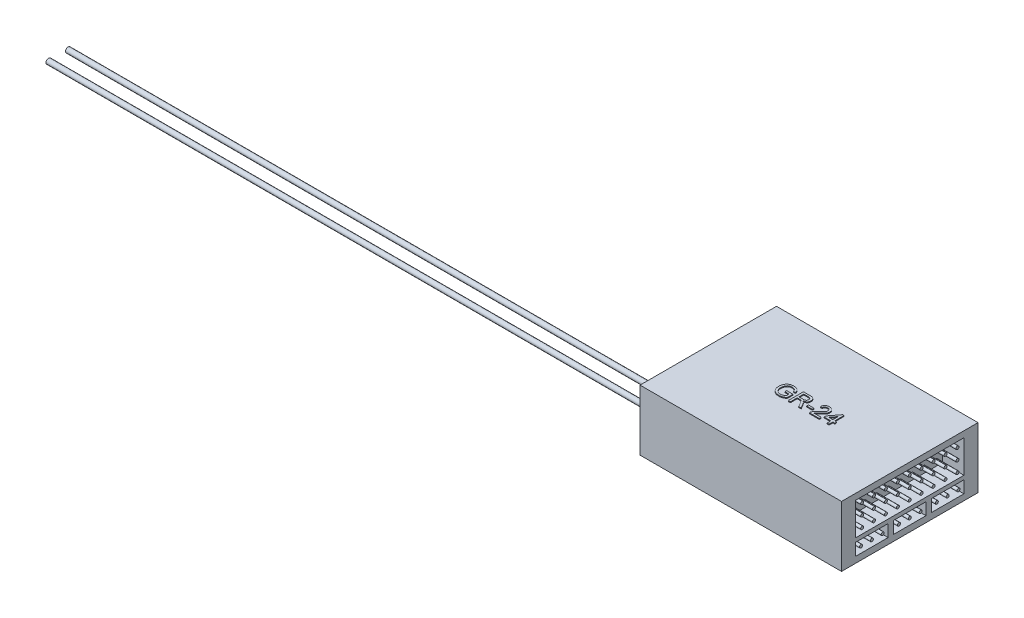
from build123d import *

# Parameters (mm, degrees)
ESQUISSE1_W                     = 46.5
ESQUISSE1_H                     = 31.5
BOSS_EXTRU_1_DEPTH              = 14
ESQUISSE2_W                     = 25
ESQUISSE2_H                     = 7.5
ESQUISSE2_W_2                   = 7.5
ESQUISSE2_H_2                   = 2.8
ENL_V_MAT_EXTRU_1_DEPTH         = 5
ESQUISSE3_R                     = 0.35
BOSS_EXTRU_2_DEPTH              = 5
BOSS_EXTRU_2_2_DEPTH            = 5
BOSS_EXTRU_2_3_DEPTH            = 5
R_P_TITION_LIN_AIRE1_COUNT      = 5
R_P_TITION_LIN_AIRE1_PITCH      = 2.75
R_P_TITION_LIN_AIRE1_COUNT_DIR2 = 5
R_P_TITION_LIN_AIRE1_PITCH_DIR2 = 2.75
ESQUISSE4_R                     = 0.35
BOSS_EXTRU_3_DEPTH              = 5
BOSS_EXTRU_3_2_DEPTH            = 5
BOSS_EXTRU_3_3_DEPTH            = 5
BOSS_EXTRU_3_4_DEPTH            = 5
BOSS_EXTRU_3_5_DEPTH            = 5
BOSS_EXTRU_3_6_DEPTH            = 5
BOSS_EXTRU_3_7_DEPTH            = 5
BOSS_EXTRU_3_8_DEPTH            = 5
BOSS_EXTRU_3_9_DEPTH            = 5
ESQUISSE5_R                     = 0.6
BOSS_EXTRU_4_DEPTH              = 143
ESQUISSE6_W                     = 7.5
ESQUISSE6_H                     = 2.8
ENL_V_MAT_EXTRU_2_DEPTH         = 5
ESQUISSE7_R                     = 0.35
BOSS_EXTRU_5_DEPTH              = 5
BOSS_EXTRU_5_2_DEPTH            = 5
BOSS_EXTRU_5_3_DEPTH            = 5
ESQUISSE8_W                     = 1.301282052
ESQUISSE8_H                     = 0.403846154
BOSS_EXTRU_6_DEPTH              = 0.2


with BuildPart() as part:
    # Esquisse1 → Boss.-Extru.1 (new body)
    with BuildSketch(Plane(origin=(0, 0, 0), x_dir=(1, 0, 0), z_dir=(0, 1, 0))):
        with Locations((23.25, 0)):
            Rectangle(ESQUISSE1_W, ESQUISSE1_H)
    extrude(amount=BOSS_EXTRU_1_DEPTH)

    # Esquisse2 → Enl_v. mat.-Extru.1 (cut)
    with BuildSketch(Plane(origin=(46.5, 0, 0), x_dir=(0, 0, -1), z_dir=(1, 0, 0))):
        with Locations((0, 8.85)):
            Rectangle(ESQUISSE2_W, ESQUISSE2_H)
        with Locations((-8.75, 2.8)):
            Rectangle(ESQUISSE2_W_2, ESQUISSE2_H_2)
        with Locations((0, 2.8)):
            Rectangle(ESQUISSE2_W_2, ESQUISSE2_H_2)
        with Locations((8.75, 2.8)):
            Rectangle(ESQUISSE2_W_2, ESQUISSE2_H_2)
    extrude(amount=-ENL_V_MAT_EXTRU_1_DEPTH, mode=Mode.SUBTRACT)


with BuildPart() as body_2:
    # Esquisse3 → Boss.-Extru.2 (new body)
    with BuildSketch(Plane(origin=(41.5, 0, 0), x_dir=(0, 0, -1), z_dir=(1, 0, 0))):
        with Locations((0, 11.35)):
            Circle(ESQUISSE3_R)
    boss_extru_2 = extrude(amount=BOSS_EXTRU_2_DEPTH)


with BuildPart() as body_3:
    # Esquisse3 → Boss.-Extru.2 2 (new body)
    with BuildSketch(Plane(origin=(41.5, 0, 0), x_dir=(0, 0, -1), z_dir=(1, 0, 0))):
        with Locations((0, 8.85)):
            Circle(ESQUISSE3_R)
    boss_extru_2_2 = extrude(amount=BOSS_EXTRU_2_2_DEPTH)


with BuildPart() as body_4:
    # Esquisse3 → Boss.-Extru.2 3 (new body)
    with BuildSketch(Plane(origin=(41.5, 0, 0), x_dir=(0, 0, -1), z_dir=(1, 0, 0))):
        with Locations((0, 6.35)):
            Circle(ESQUISSE3_R)
    boss_extru_2_3 = extrude(amount=BOSS_EXTRU_2_3_DEPTH)


with BuildPart() as part_1:
    add(part.part)

    # R_p_tition lin_aire1: Boss.-Extru.2, Boss.-Extru.2 2, Boss.-Extru.2 3 5 × 5
    with Locations(*[Vector(0, 0, -1) * (i * R_P_TITION_LIN_AIRE1_PITCH) + Vector(0, 0, 1) * (j * R_P_TITION_LIN_AIRE1_PITCH_DIR2) for i in range(R_P_TITION_LIN_AIRE1_COUNT) for j in range(R_P_TITION_LIN_AIRE1_COUNT_DIR2) if (i, j) != (0, 0)]):
        add(boss_extru_2)
        add(boss_extru_2_2)
        add(boss_extru_2_3)

    # Esquisse5 → Boss.-Extru.4 (add)
    with BuildSketch(Plane.ZY):
        with Locations(Location((4.75, 4, 0), (0, 0, 180))):
            Circle(ESQUISSE5_R)
        with Locations(Location((9.25, 4, 0), (0, 0, 180))):
            Circle(ESQUISSE5_R)
    extrude(amount=BOSS_EXTRU_4_DEPTH)

    # Esquisse6 → Enl_v. mat.-Extru.2 (cut)
    with BuildSketch(Plane.ZY):
        with Locations((3.5, 11.3)):
            Rectangle(ESQUISSE6_W, ESQUISSE6_H)
    extrude(amount=-ENL_V_MAT_EXTRU_2_DEPTH, mode=Mode.SUBTRACT)

    # Esquisse8 → Boss.-Extru.6 (add)
    # profile 1 of 5: a face of its own
    with BuildSketch(Plane(origin=(0, 14, 0), x_dir=(1, 0, 0), z_dir=(0, 1, 0))):
        with BuildLine():
            Line((18.233725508, -0.535342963), (18.233725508, -0.131496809))
            Line((18.233725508, -0.131496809), (19.669622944, -0.131496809))
            Line((19.669622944, -0.131496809), (19.669622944, -1.426468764))
            add(Edge.make_bspline(
                [(19.669622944, -1.426468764), (19.612969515, -1.469617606), (19.501468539, -1.554539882), (19.326601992, -1.665290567), (19.148867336, -1.759220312), (18.968755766, -1.836765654), (18.785648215, -1.89661519), (18.600335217, -1.939454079), (18.412614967, -1.966587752), (18.286399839, -1.969688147), (18.223208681, -1.971240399)],
                knots=[0, 0, 0, 0, 1.08433114, 2.134098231, 3.14842993, 4.143565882, 5.117308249, 6.078377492, 7.037916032, 8, 8, 8, 8], degree=3))
            add(Edge.make_bspline(
                [(18.223208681, -1.971240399), (18.180883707, -1.970590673), (18.096803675, -1.969299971), (17.972318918, -1.958257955), (17.850740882, -1.941851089), (17.732300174, -1.917725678), (17.616578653, -1.887011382), (17.503799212, -1.849054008), (17.393914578, -1.804760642), (17.287537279, -1.753980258), (17.18626623, -1.695798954), (17.090380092, -1.632007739), (17.001088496, -1.561645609), (16.918254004, -1.485288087), (16.842176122, -1.402480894), (16.771727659, -1.314324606), (16.708798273, -1.219203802), (16.651998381, -1.118868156), (16.601843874, -1.014076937), (16.558052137, -0.905724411), (16.521854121, -0.794070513), (16.491664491, -0.679609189), (16.467656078, -0.562383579), (16.450886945, -0.442026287), (16.44101582, -0.318629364), (16.439579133, -0.235280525), (16.438853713, -0.193195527)],
                knots=[0, 0, 0, 0, 1.072770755, 2.131096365, 3.165876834, 4.181397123, 5.193125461, 6.199217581, 7.195986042, 8.195005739, 9.184865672, 10.154356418, 11.112044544, 12.063776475, 13.007136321, 13.960176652, 14.921449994, 15.895149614, 16.88092309, 17.86448639, 18.855604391, 19.854360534, 20.864074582, 21.88711945, 22.933151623, 24, 24, 24, 24], degree=3))
            add(Edge.make_bspline(
                [(16.438853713, -0.193195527), (16.439581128, -0.151344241), (16.441025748, -0.068229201), (16.450981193, 0.055624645), (16.467811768, 0.177309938), (16.491047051, 0.296896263), (16.520369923, 0.414279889), (16.556899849, 0.529483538), (16.600604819, 0.642401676), (16.650103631, 0.752795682), (16.705233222, 0.859086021), (16.768544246, 0.957875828), (16.835107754, 1.051473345), (16.910415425, 1.135809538), (16.989225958, 1.215238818), (17.075395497, 1.285932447), (17.16675209, 1.350018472), (17.263690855, 1.406808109), (17.365641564, 1.456368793), (17.471387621, 1.500017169), (17.581169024, 1.536237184), (17.694356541, 1.566795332), (17.811577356, 1.589500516), (17.932529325, 1.606580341), (18.057349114, 1.616335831), (18.141862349, 1.617774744), (18.184646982, 1.618503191)],
                knots=[0, 0, 0, 0, 1.059979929, 2.105079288, 3.144800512, 4.169876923, 5.189194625, 6.207600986, 7.228841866, 8.254191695, 9.270945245, 10.257936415, 11.22408152, 12.176290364, 13.118065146, 14.055588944, 14.994904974, 15.942096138, 16.897776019, 17.864011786, 18.837383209, 19.823806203, 20.831455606, 21.859450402, 22.916351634, 24, 24, 24, 24], degree=3))
            add(Edge.make_bspline(
                [(18.184646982, 1.618503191), (18.246410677, 1.617017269), (18.36708879, 1.614113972), (18.543769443, 1.591533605), (18.710867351, 1.55289545), (18.843291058, 1.508504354), (18.942751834, 1.465244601), (19.013056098, 1.430282), (19.079140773, 1.392103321), (19.141766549, 1.351949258), (19.199535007, 1.307184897), (19.253205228, 1.259915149), (19.302918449, 1.209573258), (19.364122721, 1.137725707), (19.434137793, 1.037922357), (19.504388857, 0.902395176), (19.565920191, 0.751319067), (19.596374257, 0.643129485), (19.612130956, 0.587153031)],
                knots=[0, 0, 0, 0, 1.539867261, 3.008697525, 4.432261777, 5.810773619, 6.484177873, 7.135742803, 7.767512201, 8.386601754, 8.989234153, 9.587908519, 10.168964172, 10.7517707, 11.940093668, 13.199243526, 14.550910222, 16, 16, 16, 16], degree=3))
            Line((19.612130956, 0.587153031), (19.16060852, 0.4735713))
            add(Edge.make_bspline(
                [(19.16060852, 0.4735713), (19.147576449, 0.515107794), (19.122617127, 0.594659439), (19.07865403, 0.70584478), (19.027440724, 0.801852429), (18.972681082, 0.886360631), (18.907443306, 0.959057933), (18.831699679, 1.023472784), (18.74318225, 1.079414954), (18.64384022, 1.12731246), (18.535837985, 1.166424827), (18.420887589, 1.194297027), (18.300159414, 1.211631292), (18.217659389, 1.213634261), (18.175532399, 1.214657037)],
                knots=[0, 0, 0, 0, 1.164883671, 2.23101188, 3.193404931, 4.072828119, 4.918883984, 5.797350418, 6.725503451, 7.712871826, 8.743577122, 9.793233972, 10.87315899, 12, 12, 12, 12], degree=3))
            add(Edge.make_bspline(
                [(18.175532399, 1.214657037), (18.125701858, 1.213400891), (18.02922382, 1.210968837), (17.889413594, 1.193534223), (17.760033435, 1.163792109), (17.641516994, 1.121412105), (17.534362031, 1.06931814), (17.437035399, 1.01041139), (17.351187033, 0.942973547), (17.276490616, 0.867864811), (17.211529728, 0.787516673), (17.153602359, 0.703765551), (17.103226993, 0.615935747), (17.076320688, 0.554236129), (17.06285211, 0.523350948)],
                knots=[0, 0, 0, 0, 1.282088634, 2.482280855, 3.618640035, 4.691464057, 5.71354971, 6.679981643, 7.61357903, 8.515091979, 9.399860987, 10.268958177, 11.133486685, 12, 12, 12, 12], degree=3))
            add(Edge.make_bspline(
                [(17.06285211, 0.523350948), (17.042739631, 0.46902939), (17.002256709, 0.359689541), (16.962708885, 0.187366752), (16.937180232, 0.008562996), (16.934038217, -0.113176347), (16.932443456, -0.17496636)],
                knots=[0, 0, 0, 0, 0.971932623, 1.956331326, 2.96271565, 4, 4, 4, 4], degree=3))
            add(Edge.make_bspline(
                [(16.932443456, -0.17496636), (16.932685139, -0.212845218), (16.933158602, -0.287051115), (16.941644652, -0.396006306), (16.952740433, -0.500525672), (16.970748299, -0.60009665), (16.992158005, -0.695016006), (17.01871357, -0.785335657), (17.051173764, -0.870604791), (17.087429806, -0.951658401), (17.128912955, -1.027620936), (17.175108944, -1.098411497), (17.225846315, -1.163992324), (17.280952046, -1.224435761), (17.3396087, -1.280955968), (17.403653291, -1.33139608), (17.472365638, -1.376488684), (17.568766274, -1.430188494), (17.695873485, -1.484399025), (17.853431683, -1.532765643), (18.016270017, -1.561491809), (18.126343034, -1.565415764), (18.181842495, -1.567394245)],
                knots=[0, 0, 0, 0, 1.070760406, 2.097653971, 3.088708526, 4.041547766, 4.95691435, 5.839291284, 6.700934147, 7.534993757, 8.348268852, 9.145600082, 9.922850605, 10.690119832, 11.456705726, 12.223547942, 12.991528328, 13.778467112, 15.341275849, 16.888285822, 18.431055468, 20, 20, 20, 20], degree=3))
            add(Edge.make_bspline(
                [(18.181842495, -1.567394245), (18.230527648, -1.565791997), (18.327673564, -1.562594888), (18.472303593, -1.54040942), (18.614659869, -1.502737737), (18.752295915, -1.451876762), (18.881045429, -1.393619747), (18.995010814, -1.331197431), (19.093974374, -1.268910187), (19.14964125, -1.221216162), (19.1760332, -1.198604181)],
                knots=[0, 0, 0, 0, 1.08078364, 2.156585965, 3.240205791, 4.344938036, 5.41078367, 6.374425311, 7.229306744, 8, 8, 8, 8], degree=3))
            Line((19.1760332, -1.198604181), (19.1760332, -0.535342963))
            Line((19.1760332, -0.535342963), (18.233725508, -0.535342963))
        make_face()
    # profile 2 of 5: a face of its own
    with BuildSketch(Plane(origin=(0, 14, 0), x_dir=(1, 0, 0), z_dir=(0, 1, 0))):
        with BuildLine():
            Line((20.387571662, -1.926368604), (20.387571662, 1.573631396))
            Line((20.387571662, 1.573631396), (21.906201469, 1.573631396))
            add(Edge.make_bspline(
                [(21.906201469, 1.573631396), (21.941960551, 1.573351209), (22.011168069, 1.57280894), (22.111533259, 1.568970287), (22.205214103, 1.560695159), (22.292382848, 1.551746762), (22.373024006, 1.538012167), (22.447054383, 1.522258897), (22.514588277, 1.503512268), (22.575927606, 1.481371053), (22.632837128, 1.456321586), (22.685587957, 1.425414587), (22.736372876, 1.391547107), (22.783307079, 1.351757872), (22.827628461, 1.308192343), (22.869295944, 1.260258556), (22.907692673, 1.207540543), (22.95505044, 1.132090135), (23.005855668, 1.03160608), (23.048184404, 0.903008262), (23.075477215, 0.76849025), (23.078397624, 0.676562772), (23.079879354, 0.62992146)],
                knots=[0, 0, 0, 0, 1.242255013, 2.404239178, 3.487702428, 4.508875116, 5.447164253, 6.327763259, 7.137389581, 7.87956647, 8.591787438, 9.293660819, 10.000726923, 10.709654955, 11.427269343, 12.158170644, 12.913245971, 13.690346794, 15.251572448, 16.809945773, 18.381459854, 20, 20, 20, 20], degree=3))
            add(Edge.make_bspline(
                [(23.079879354, 0.62992146), (23.079194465, 0.599981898), (23.077841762, 0.540849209), (23.06747992, 0.453908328), (23.048731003, 0.370839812), (23.024689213, 0.290916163), (22.991783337, 0.21526977), (22.953663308, 0.142355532), (22.906438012, 0.0741766), (22.853564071, 0.008917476), (22.792931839, -0.052024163), (22.724007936, -0.106449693), (22.647475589, -0.155405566), (22.562974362, -0.19754107), (22.471476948, -0.236054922), (22.371835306, -0.26706813), (22.264451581, -0.292392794), (22.190008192, -0.304655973), (22.151594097, -0.310983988)],
                knots=[0, 0, 0, 0, 0.982609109, 1.940720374, 2.867584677, 3.775009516, 4.675469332, 5.571146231, 6.471115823, 7.392408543, 8.32534739, 9.286126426, 10.269214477, 11.301811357, 12.381622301, 13.524260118, 14.722474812, 16, 16, 16, 16], degree=3))
            add(Edge.make_bspline(
                [(22.151594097, -0.310983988), (22.179772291, -0.32521899), (22.233283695, -0.352251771), (22.307370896, -0.394638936), (22.370172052, -0.437948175), (22.406555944, -0.468924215), (22.423629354, -0.48345995)],
                knots=[0, 0, 0, 0, 1.172304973, 2.226249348, 3.167654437, 4, 4, 4, 4], degree=3))
            add(Edge.make_bspline(
                [(22.423629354, -0.48345995), (22.456692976, -0.515871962), (22.524608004, -0.582448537), (22.618197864, -0.695847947), (22.708936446, -0.822078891), (22.764066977, -0.913306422), (22.792419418, -0.96022277)],
                knots=[0, 0, 0, 0, 0.918110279, 1.885863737, 2.912745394, 4, 4, 4, 4], degree=3))
            Line((22.792419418, -0.96022277), (23.366638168, -1.926368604))
            Line((23.366638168, -1.926368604), (22.800832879, -1.926368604))
            Line((22.800832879, -1.926368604), (22.364735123, -1.187386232))
            add(Edge.make_bspline(
                [(22.364735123, -1.187386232), (22.349055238, -1.161458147), (22.318670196, -1.111213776), (22.274780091, -1.037834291), (22.231747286, -0.970276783), (22.191835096, -0.906610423), (22.153423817, -0.84799104), (22.116884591, -0.794215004), (22.083222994, -0.744576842), (22.041528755, -0.686785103), (21.993003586, -0.622838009), (21.936378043, -0.556984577), (21.882453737, -0.504480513), (21.816044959, -0.452994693), (21.733787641, -0.404838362), (21.663867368, -0.382711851), (21.629959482, -0.371981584)],
                knots=[0, 0, 0, 0, 1.130940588, 2.191577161, 3.191089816, 4.120344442, 4.99615009, 5.80661983, 6.546979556, 7.234477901, 8.466216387, 9.541989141, 10.473533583, 11.269175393, 12.675684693, 14, 14, 14, 14], degree=3))
            add(Edge.make_bspline(
                [(21.629959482, -0.371981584), (21.61573299, -0.369416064), (21.583253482, -0.363558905), (21.528103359, -0.359733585), (21.461282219, -0.35567352), (21.4128558, -0.355791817), (21.386670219, -0.355855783)],
                knots=[0, 0, 0, 0, 0.709978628, 1.620902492, 2.713552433, 4, 4, 4, 4], degree=3))
            Line((21.386670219, -0.355855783), (20.881161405, -0.355855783))
            Line((20.881161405, -0.355855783), (20.881161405, -1.926368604))
            Line((20.881161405, -1.926368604), (20.387571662, -1.926368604))
        make_face()
        with BuildLine():
            Line((20.881161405, 0.047990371), (21.818561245, 0.047990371))
            add(Edge.make_bspline(
                [(21.818561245, 0.047990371), (21.865566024, 0.048725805), (21.953437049, 0.050100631), (22.076310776, 0.061840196), (22.181026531, 0.080494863), (22.269654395, 0.10770488), (22.34411579, 0.145481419), (22.408876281, 0.191519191), (22.462693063, 0.249186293), (22.507463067, 0.31425134), (22.54226371, 0.385852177), (22.567367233, 0.461058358), (22.583797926, 0.539237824), (22.585451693, 0.592445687), (22.58628961, 0.619404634)],
                knots=[0, 0, 0, 0, 1.546323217, 2.890706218, 4.056530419, 5.041445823, 5.928701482, 6.793137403, 7.641659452, 8.509781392, 9.383301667, 10.251423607, 11.114044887, 12, 12, 12, 12], degree=3))
            add(Edge.make_bspline(
                [(22.58628961, 0.619404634), (22.585638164, 0.639050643), (22.584362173, 0.677531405), (22.577673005, 0.734010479), (22.564667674, 0.787678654), (22.547494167, 0.838819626), (22.524546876, 0.887058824), (22.49728643, 0.932770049), (22.464756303, 0.975699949), (22.427494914, 1.015979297), (22.384712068, 1.052629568), (22.335844, 1.084250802), (22.281276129, 1.111122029), (22.22094503, 1.132448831), (22.155040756, 1.149506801), (22.083188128, 1.160854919), (22.005715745, 1.169066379), (21.952031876, 1.169541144), (21.924430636, 1.169785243)],
                knots=[0, 0, 0, 0, 0.965208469, 1.890559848, 2.786986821, 3.67262109, 4.535197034, 5.405224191, 6.282113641, 7.175449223, 8.095446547, 9.040936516, 10.026471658, 11.075712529, 12.17809725, 13.364958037, 14.645208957, 16, 16, 16, 16], degree=3))
            Line((21.924430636, 1.169785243), (20.881161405, 1.169785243))
            Line((20.881161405, 1.169785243), (20.881161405, 0.047990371))
        make_face(mode=Mode.SUBTRACT)
    # profile 3 of 5: a face of its own
    with BuildSketch(Plane(origin=(0, 14, 0), x_dir=(1, 0, 0), z_dir=(0, 1, 0))):
        with Locations((24.268981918, -0.692394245)):
            Rectangle(ESQUISSE8_W, ESQUISSE8_H)
    # profile 4 of 5: a face of its own
    with BuildSketch(Plane(origin=(0, 14, 0), x_dir=(1, 0, 0), z_dir=(0, 1, 0))):
        with BuildLine():
            Line((27.522187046, -1.477650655), (27.522187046, -1.926368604))
            Line((27.522187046, -1.926368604), (25.233725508, -1.926368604))
            add(Edge.make_bspline(
                [(25.233725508, -1.926368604), (25.233678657, -1.899700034), (25.233585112, -1.846452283), (25.24259549, -1.767702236), (25.256707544, -1.689996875), (25.27266404, -1.640167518), (25.280700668, -1.615070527)],
                knots=[0, 0, 0, 0, 1.01057331, 2.01775941, 3.001627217, 4, 4, 4, 4], degree=3))
            add(Edge.make_bspline(
                [(25.280700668, -1.615070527), (25.295549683, -1.574065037), (25.325784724, -1.490571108), (25.387041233, -1.370101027), (25.459093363, -1.250359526), (25.529246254, -1.152873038), (25.593491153, -1.074988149), (25.647368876, -1.014052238), (25.707075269, -0.951677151), (25.772562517, -0.887874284), (25.843200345, -0.822230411), (25.919085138, -0.754526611), (26.001112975, -0.686024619), (26.058376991, -0.640618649), (26.087691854, -0.617374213)],
                knots=[0, 0, 0, 0, 1.204657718, 2.452881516, 3.728232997, 5.065887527, 5.768225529, 6.518857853, 7.313994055, 8.154655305, 9.046094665, 9.979688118, 10.965752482, 12, 12, 12, 12], degree=3))
            add(Edge.make_bspline(
                [(26.087691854, -0.617374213), (26.132726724, -0.579469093), (26.219444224, -0.506480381), (26.341902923, -0.398171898), (26.453749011, -0.297601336), (26.553201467, -0.203005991), (26.641073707, -0.115303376), (26.717572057, -0.034692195), (26.783354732, 0.038575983), (26.837618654, 0.107153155), (26.88340279, 0.171909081), (26.922200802, 0.235074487), (26.954533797, 0.297752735), (26.981462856, 0.359745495), (27.002761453, 0.421317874), (27.017279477, 0.482649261), (27.027125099, 0.5431311), (27.028110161, 0.583376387), (27.028597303, 0.603278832)],
                knots=[0, 0, 0, 0, 1.782554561, 3.432421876, 4.950675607, 6.337395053, 7.588547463, 8.709982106, 9.702713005, 10.569305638, 11.356701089, 12.103210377, 12.812277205, 13.490692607, 14.148717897, 14.782152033, 15.397739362, 16, 16, 16, 16], degree=3))
            add(Edge.make_bspline(
                [(27.028597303, 0.603278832), (27.028110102, 0.62294906), (27.027154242, 0.661540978), (27.018085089, 0.718020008), (27.005460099, 0.772410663), (26.985049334, 0.823733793), (26.960754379, 0.873509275), (26.929590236, 0.920164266), (26.893539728, 0.964861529), (26.852264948, 1.006422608), (26.807183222, 1.045413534), (26.756810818, 1.077824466), (26.704456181, 1.107003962), (26.64831312, 1.130465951), (26.588472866, 1.147694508), (26.525371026, 1.160198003), (26.459017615, 1.168125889), (26.413736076, 1.169223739), (26.390576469, 1.169785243)],
                knots=[0, 0, 0, 0, 0.988194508, 1.938783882, 2.870742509, 3.789494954, 4.709148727, 5.651055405, 6.603531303, 7.592354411, 8.592907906, 9.593461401, 10.59787167, 11.603930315, 12.645063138, 13.723588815, 14.835711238, 16, 16, 16, 16], degree=3))
            add(Edge.make_bspline(
                [(26.390576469, 1.169785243), (26.366247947, 1.169226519), (26.31863524, 1.168133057), (26.249038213, 1.160173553), (26.1829679, 1.148012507), (26.120582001, 1.129419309), (26.061956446, 1.105996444), (26.007330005, 1.076513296), (25.955827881, 1.043232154), (25.909072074, 1.003829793), (25.866791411, 0.960140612), (25.829256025, 0.91257631), (25.798501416, 0.860218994), (25.773102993, 0.804219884), (25.752680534, 0.744402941), (25.737854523, 0.680310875), (25.729771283, 0.612128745), (25.728145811, 0.565437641), (25.727315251, 0.541580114)],
                knots=[0, 0, 0, 0, 1.131143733, 2.213731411, 3.253917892, 4.251203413, 5.236093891, 6.184197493, 7.13373276, 8.082770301, 9.020476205, 9.957489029, 10.893177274, 11.836722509, 12.812818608, 13.827831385, 14.890097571, 16, 16, 16, 16], degree=3))
            Line((25.727315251, 0.541580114), (25.278597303, 0.586451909))
            add(Edge.make_bspline(
                [(25.278597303, 0.586451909), (25.283188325, 0.625558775), (25.292119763, 0.701637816), (25.314366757, 0.811825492), (25.345599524, 0.914331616), (25.382972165, 1.010585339), (25.429822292, 1.098948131), (25.482782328, 1.181247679), (25.545246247, 1.254873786), (25.614252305, 1.322147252), (25.69055654, 1.381432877), (25.77344219, 1.433227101), (25.862871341, 1.476549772), (25.958345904, 1.512419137), (26.060085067, 1.539634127), (26.1679449, 1.559149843), (26.282098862, 1.571179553), (26.360398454, 1.572802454), (26.400392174, 1.573631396)],
                knots=[0, 0, 0, 0, 1.130804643, 2.199883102, 3.223565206, 4.205909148, 5.160801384, 6.091796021, 7.01151579, 7.927798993, 8.855738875, 9.7815393, 10.730299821, 11.705391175, 12.706931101, 13.751121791, 14.851322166, 16, 16, 16, 16], degree=3))
            add(Edge.make_bspline(
                [(26.400392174, 1.573631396), (26.440864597, 1.572938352), (26.519705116, 1.571588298), (26.634588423, 1.55777453), (26.742983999, 1.536259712), (26.845289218, 1.506274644), (26.940899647, 1.466955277), (27.029888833, 1.41891589), (27.112667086, 1.362625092), (27.18785135, 1.297407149), (27.255646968, 1.22621084), (27.315059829, 1.15022903), (27.364731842, 1.069786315), (27.407024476, 0.985979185), (27.438394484, 0.89703685), (27.460454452, 0.804168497), (27.47544484, 0.707294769), (27.476683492, 0.641197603), (27.477315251, 0.607485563)],
                knots=[0, 0, 0, 0, 1.195390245, 2.328627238, 3.413424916, 4.457841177, 5.473507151, 6.462241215, 7.441013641, 8.425227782, 9.397253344, 10.342087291, 11.269524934, 12.186751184, 13.110685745, 14.048630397, 15.004728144, 16, 16, 16, 16], degree=3))
            add(Edge.make_bspline(
                [(27.477315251, 0.607485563), (27.476350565, 0.572850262), (27.474419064, 0.503503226), (27.459343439, 0.399849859), (27.433548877, 0.297321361), (27.399352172, 0.1946699), (27.352632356, 0.091488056), (27.293609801, -0.013647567), (27.220385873, -0.121125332), (27.149964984, -0.212493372), (27.084414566, -0.28908283), (27.026310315, -0.35212043), (26.959087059, -0.419093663), (26.885266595, -0.492321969), (26.801838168, -0.569206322), (26.711198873, -0.652049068), (26.61136457, -0.738670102), (26.542060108, -0.797845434), (26.506261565, -0.828411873)],
                knots=[0, 0, 0, 0, 0.927118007, 1.856282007, 2.79721255, 3.754929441, 4.749232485, 5.824981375, 6.979078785, 8.228161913, 8.911614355, 9.677694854, 10.522803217, 11.452009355, 12.461436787, 13.560019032, 14.739651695, 16, 16, 16, 16], degree=3))
            add(Edge.make_bspline(
                [(26.506261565, -0.828411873), (26.475605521, -0.853369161), (26.417149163, -0.900958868), (26.33398367, -0.96995094), (26.259492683, -1.033214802), (26.191934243, -1.088686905), (26.133768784, -1.139050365), (26.082947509, -1.182099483), (26.041316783, -1.219998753), (25.977920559, -1.277568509), (25.897623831, -1.359628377), (25.838457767, -1.439363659), (25.810047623, -1.477650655)],
                knots=[0, 0, 0, 0, 1.241996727, 2.368296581, 3.394949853, 4.3125351, 5.114548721, 5.812230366, 6.404953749, 6.883082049, 8.503329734, 10, 10, 10, 10], degree=3))
            Line((25.810047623, -1.477650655), (27.522187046, -1.477650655))
        make_face()
    # profile 5 of 5: a face of its own
    with BuildSketch(Plane(origin=(0, 14, 0), x_dir=(1, 0, 0), z_dir=(0, 1, 0))):
        Polygon((29.361930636, -1.926368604), (29.361930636, -1.073804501), (27.83628961, -1.073804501), (27.83628961, -0.625086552), (29.49654602, 1.528759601), (29.810648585, 1.528759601), (29.810648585, -0.625086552), (30.259366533, -0.625086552), (30.259366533, -1.073804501), (29.810648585, -1.073804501), (29.810648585, -1.926368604), align=None)
        Polygon((29.361930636, -0.625086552), (29.361930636, 0.635530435), (28.390175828, -0.625086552), align=None, mode=Mode.SUBTRACT)
    extrude(amount=BOSS_EXTRU_6_DEPTH)


with BuildPart() as body_5:
    # Esquisse4 → Boss.-Extru.3 (new body)
    with BuildSketch(Plane(origin=(41.5, 0, 0), x_dir=(0, 0, -1), z_dir=(1, 0, 0))):
        with Locations((-11.25, 2.8)):
            Circle(ESQUISSE4_R)
    extrude(amount=BOSS_EXTRU_3_DEPTH)


with BuildPart() as body_6:
    # Esquisse4 → Boss.-Extru.3 2 (new body)
    with BuildSketch(Plane(origin=(41.5, 0, 0), x_dir=(0, 0, -1), z_dir=(1, 0, 0))):
        with Locations((-8.75, 2.8)):
            Circle(ESQUISSE4_R)
    extrude(amount=BOSS_EXTRU_3_2_DEPTH)


with BuildPart() as body_7:
    # Esquisse4 → Boss.-Extru.3 3 (new body)
    with BuildSketch(Plane(origin=(41.5, 0, 0), x_dir=(0, 0, -1), z_dir=(1, 0, 0))):
        with Locations((-6.25, 2.8)):
            Circle(ESQUISSE4_R)
    extrude(amount=BOSS_EXTRU_3_3_DEPTH)


with BuildPart() as body_8:
    # Esquisse4 → Boss.-Extru.3 4 (new body)
    with BuildSketch(Plane(origin=(41.5, 0, 0), x_dir=(0, 0, -1), z_dir=(1, 0, 0))):
        with Locations((-2.5, 2.8)):
            Circle(ESQUISSE4_R)
    extrude(amount=BOSS_EXTRU_3_4_DEPTH)


with BuildPart() as body_9:
    # Esquisse4 → Boss.-Extru.3 5 (new body)
    with BuildSketch(Plane(origin=(41.5, 0, 0), x_dir=(0, 0, -1), z_dir=(1, 0, 0))):
        with Locations((0, 2.8)):
            Circle(ESQUISSE4_R)
    extrude(amount=BOSS_EXTRU_3_5_DEPTH)


with BuildPart() as body_10:
    # Esquisse4 → Boss.-Extru.3 6 (new body)
    with BuildSketch(Plane(origin=(41.5, 0, 0), x_dir=(0, 0, -1), z_dir=(1, 0, 0))):
        with Locations((2.5, 2.8)):
            Circle(ESQUISSE4_R)
    extrude(amount=BOSS_EXTRU_3_6_DEPTH)


with BuildPart() as body_11:
    # Esquisse4 → Boss.-Extru.3 7 (new body)
    with BuildSketch(Plane(origin=(41.5, 0, 0), x_dir=(0, 0, -1), z_dir=(1, 0, 0))):
        with Locations((6.25, 2.8)):
            Circle(ESQUISSE4_R)
    extrude(amount=BOSS_EXTRU_3_7_DEPTH)


with BuildPart() as body_12:
    # Esquisse4 → Boss.-Extru.3 8 (new body)
    with BuildSketch(Plane(origin=(41.5, 0, 0), x_dir=(0, 0, -1), z_dir=(1, 0, 0))):
        with Locations((8.75, 2.8)):
            Circle(ESQUISSE4_R)
    extrude(amount=BOSS_EXTRU_3_8_DEPTH)


with BuildPart() as body_13:
    # Esquisse4 → Boss.-Extru.3 9 (new body)
    with BuildSketch(Plane(origin=(41.5, 0, 0), x_dir=(0, 0, -1), z_dir=(1, 0, 0))):
        with Locations((11.25, 2.8)):
            Circle(ESQUISSE4_R)
    extrude(amount=BOSS_EXTRU_3_9_DEPTH)


with BuildPart() as body_14:
    # Esquisse7 → Boss.-Extru.5 (new body)
    with BuildSketch(Plane.ZY.offset(-5)):
        with Locations((1, 11.3)):
            Circle(ESQUISSE7_R)
    extrude(amount=BOSS_EXTRU_5_DEPTH)


with BuildPart() as body_15:
    # Esquisse7 → Boss.-Extru.5 2 (new body)
    with BuildSketch(Plane.ZY.offset(-5)):
        with Locations((3.5, 11.3)):
            Circle(ESQUISSE7_R)
    extrude(amount=BOSS_EXTRU_5_2_DEPTH)


with BuildPart() as body_16:
    # Esquisse7 → Boss.-Extru.5 3 (new body)
    with BuildSketch(Plane.ZY.offset(-5)):
        with Locations((6, 11.3)):
            Circle(ESQUISSE7_R)
    extrude(amount=BOSS_EXTRU_5_3_DEPTH)


solid = Compound([body_2.part, body_3.part, body_4.part, part_1.part, body_5.part, body_6.part, body_7.part, body_8.part, body_9.part, body_10.part, body_11.part, body_12.part, body_13.part, body_14.part, body_15.part, body_16.part])
